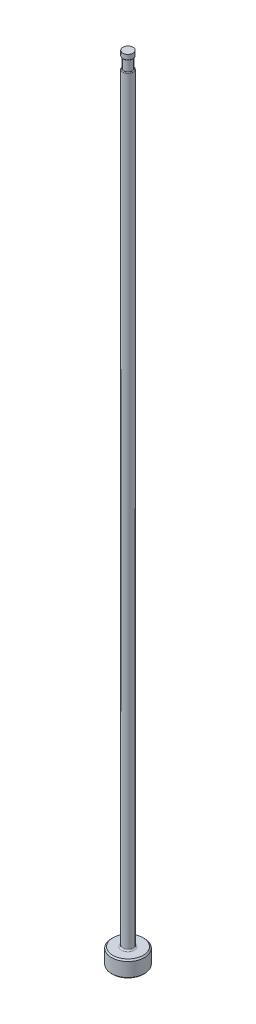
from build123d import *

# Parameters (mm, degrees)
CHAMFER1_SIZE     = 0.254
FILLET1_R         = 0.254
SKETCH2_W         = 0.2032
SKETCH2_H         = 2.032
D_SLOT_DEPTH      = 153.466131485
D_SLOT_DEPTH_BACK = 153.466131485
SKETCH5_W         = 0.00508
SKETCH5_H         = 1.016
FILLET2_R         = 0.127


with BuildPart() as part:
    # Sketch1 → Revolve1 (revolve)
    with BuildSketch(Plane.XY, mode=Mode.PRIVATE) as revolve1_sk:
        Polygon((0, 0), (-3.175, 0), (-3.175, 3.175), (-0.99187, 3.175), (-0.99187, 152.4), (0, 152.4), align=None)
    revolve(revolve1_sk.sketch.rotate(Axis((0, 259.958771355, 0), (0, -1, 0)), 270), axis=Axis((0, 259.958771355, 0), (0, -1, 0)))

    # Chamfer1
    chamfer1_edges = [part.edges().sort_by_distance(p)[0] for p in [
        (0, 3.175, -3.175),
        (0, 0, -3.175),
    ]]
    chamfer(chamfer1_edges, length=CHAMFER1_SIZE)

    # Fillet1
    fillet1_edges = [part.edges().sort_by_distance(p)[0] for p in [
        (0, 3.175, -0.99187),
    ]]
    fillet(fillet1_edges, radius=FILLET1_R)

    # Sketch2 → Vent Relief (revolve, cut)
    with BuildSketch(Plane.XY, mode=Mode.PRIVATE) as vent_relief_sk:
        with Locations((-0.89027, 150.368)):
            Rectangle(SKETCH2_W, SKETCH2_H)
    revolve(vent_relief_sk.sketch.rotate(Axis((0, 153.448281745, 0), (0, -1, 0)), 270), axis=Axis((0, 153.448281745, 0), (0, -1, 0)), mode=Mode.SUBTRACT)

    # Sketch3 → D-Slot (cut, two sides: drawn at the far end of the back side and taken through both)
    with BuildSketch(Plane.XY.offset(-D_SLOT_DEPTH_BACK)):
        with BuildLine():
            Line((-0.78867, 150.368), (-0.78867, 86.868))
            ThreePointArc((-0.78867, 86.868), (-0.839883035, 86.300038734), (-0.99187, 85.7504))
            Line((-0.99187, 85.7504), (-0.99187, 150.368))
            Line((-0.99187, 150.368), (-0.78867, 150.368))
        make_face()
    extrude(amount=D_SLOT_DEPTH + D_SLOT_DEPTH_BACK, mode=Mode.SUBTRACT)

    # Sketch5 → Vent Diameter (revolve, cut)
    with BuildSketch(Plane.XY, mode=Mode.PRIVATE) as vent_diameter_sk:
        with Locations((-0.98933, 151.892)):
            Rectangle(SKETCH5_W, SKETCH5_H)
    revolve(vent_diameter_sk.sketch.rotate(Axis((0, 152.687735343, 0), (0, -1, 0)), 90), axis=Axis((0, 152.687735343, 0), (0, -1, 0)), mode=Mode.SUBTRACT)

    # Fillet2
    fillet2_edges = [part.edges().sort_by_distance(p)[0] for p in [
        (0.888937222, 149.352, -0.439996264),
        (0, 151.384, 0.98679),
    ]]
    fillet(fillet2_edges, radius=FILLET2_R)


solid = part.part
